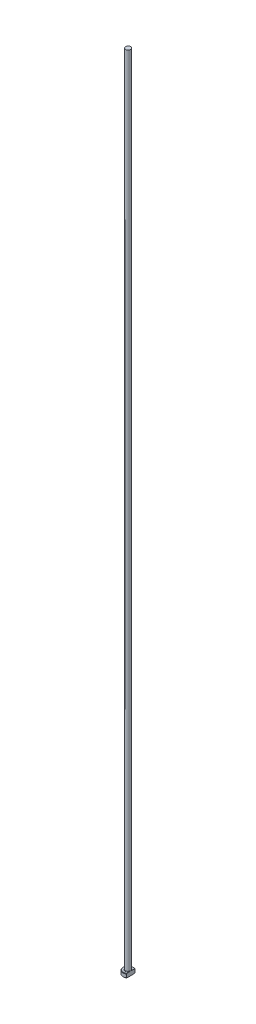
ISO-10303-21;
HEADER;
FILE_DESCRIPTION(('STEP AP214'),'2;1');
FILE_NAME('part.step','',(''),(''),'','','');
FILE_SCHEMA(('AUTOMOTIVE_DESIGN { 1 0 10303 214 1 1 1 1 }'));
ENDSEC;
DATA;
#1=APPLICATION_CONTEXT('core data for automotive mechanical design processes');
#2=APPLICATION_PROTOCOL_DEFINITION('international standard','automotive_design',2000,#1);
#3=PRODUCT_CONTEXT('',#1,'mechanical');
#4=PRODUCT('Part','Part','',(#3));
#5=PRODUCT_RELATED_PRODUCT_CATEGORY('part','',(#4));
#6=PRODUCT_DEFINITION_FORMATION('','',#4);
#7=PRODUCT_DEFINITION_CONTEXT('part definition',#1,'design');
#8=PRODUCT_DEFINITION('design','',#6,#7);
#9=PRODUCT_DEFINITION_SHAPE('','',#8);
#10=(LENGTH_UNIT() NAMED_UNIT(*) SI_UNIT(.MILLI.,.METRE.));
#11=(NAMED_UNIT(*) PLANE_ANGLE_UNIT() SI_UNIT($,.RADIAN.));
#12=(NAMED_UNIT(*) SI_UNIT($,.STERADIAN.) SOLID_ANGLE_UNIT());
#13=UNCERTAINTY_MEASURE_WITH_UNIT(LENGTH_MEASURE(1.E-05),#10,'distance_accuracy_value','');
#14=(GEOMETRIC_REPRESENTATION_CONTEXT(3) GLOBAL_UNCERTAINTY_ASSIGNED_CONTEXT((#13)) GLOBAL_UNIT_ASSIGNED_CONTEXT((#10,
#11,#12)) REPRESENTATION_CONTEXT('',''));
#15=CARTESIAN_POINT('',(0.,0.,0.));
#16=DIRECTION('',(0.,0.,1.));
#17=DIRECTION('',(1.,0.,0.));
#18=AXIS2_PLACEMENT_3D('',#15,#16,#17);
#19=CARTESIAN_POINT('',(0.,0.,0.));
#20=DIRECTION('',(0.,-1.,0.));
#21=DIRECTION('',(0.,0.,-1.));
#22=AXIS2_PLACEMENT_3D('',#19,#20,#21);
#23=PLANE('',#22);
#24=CARTESIAN_POINT('',(0.,0.,0.));
#25=DIRECTION('',(0.,-1.,0.));
#26=DIRECTION('',(0.,0.,-1.));
#27=AXIS2_PLACEMENT_3D('',#24,#25,#26);
#28=CIRCLE('',#27,2.30000000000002);
#29=CARTESIAN_POINT('',(1.24999999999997,0.,1.93067345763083));
#30=VERTEX_POINT('',#29);
#31=CARTESIAN_POINT('',(1.24999999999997,0.,-1.93067345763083));
#32=VERTEX_POINT('',#31);
#33=EDGE_CURVE('E98',#30,#32,#28,.T.);
#34=ORIENTED_EDGE('',*,*,#33,.T.);
#35=DIRECTION('',(0.,0.,1.));
#36=VECTOR('',#35,1.);
#37=CARTESIAN_POINT('',(1.24999999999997,0.,-2.16506350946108));
#38=LINE('',#37,#36);
#39=EDGE_CURVE('E83',#32,#30,#38,.T.);
#40=ORIENTED_EDGE('',*,*,#39,.T.);
#41=EDGE_LOOP('',(#34,#40));
#42=FACE_BOUND('',#41,.T.);
#43=ADVANCED_FACE('F32',(#42),#23,.T.);
#44=CARTESIAN_POINT('',(0.,259.958771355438,0.));
#45=DIRECTION('',(0.,1.,0.));
#46=DIRECTION('',(0.,0.,1.));
#47=AXIS2_PLACEMENT_3D('',#44,#45,#46);
#48=CYLINDRICAL_SURFACE('',#47,2.49999999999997);
#49=CARTESIAN_POINT('',(0.,1.79999999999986,0.));
#50=DIRECTION('',(0.,1.,0.));
#51=DIRECTION('',(0.,0.,1.));
#52=AXIS2_PLACEMENT_3D('',#49,#50,#51);
#53=CIRCLE('',#52,2.49999999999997);
#54=CARTESIAN_POINT('',(1.24999999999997,1.79999999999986,2.16506350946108));
#55=VERTEX_POINT('',#54);
#56=CARTESIAN_POINT('',(1.24999999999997,1.79999999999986,-2.16506350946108));
#57=VERTEX_POINT('',#56);
#58=EDGE_CURVE('E104',#55,#57,#53,.F.);
#59=ORIENTED_EDGE('',*,*,#58,.T.);
#60=DIRECTION('',(0.,-1.,0.));
#61=VECTOR('',#60,1.);
#62=CARTESIAN_POINT('',(1.24999999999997,400.,-2.16506350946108));
#63=LINE('',#62,#61);
#64=CARTESIAN_POINT('',(1.24999999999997,0.199999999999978,-2.16506350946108));
#65=VERTEX_POINT('',#64);
#66=EDGE_CURVE('E183',#57,#65,#63,.T.);
#67=ORIENTED_EDGE('',*,*,#66,.T.);
#68=CARTESIAN_POINT('',(0.,0.199999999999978,0.));
#69=DIRECTION('',(0.,-1.,0.));
#70=DIRECTION('',(0.,0.,-1.));
#71=AXIS2_PLACEMENT_3D('',#68,#69,#70);
#72=CIRCLE('',#71,2.49999999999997);
#73=CARTESIAN_POINT('',(1.24999999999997,0.199999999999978,2.16506350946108));
#74=VERTEX_POINT('',#73);
#75=EDGE_CURVE('E100',#65,#74,#72,.F.);
#76=ORIENTED_EDGE('',*,*,#75,.T.);
#77=DIRECTION('',(0.,-1.,0.));
#78=VECTOR('',#77,1.);
#79=CARTESIAN_POINT('',(1.24999999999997,400.,2.16506350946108));
#80=LINE('',#79,#78);
#81=EDGE_CURVE('E93',#55,#74,#80,.T.);
#82=ORIENTED_EDGE('',*,*,#81,.F.);
#83=EDGE_LOOP('',(#59,#67,#76,#82));
#84=FACE_BOUND('',#83,.T.);
#85=ADVANCED_FACE('F158',(#84),#48,.T.);
#86=CARTESIAN_POINT('',(-2.49999999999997,2.,0.));
#87=DIRECTION('',(0.,1.,0.));
#88=DIRECTION('',(0.,0.,1.));
#89=AXIS2_PLACEMENT_3D('',#86,#87,#88);
#90=PLANE('',#89);
#91=CARTESIAN_POINT('',(0.,2.,0.));
#92=DIRECTION('',(0.,1.,0.));
#93=DIRECTION('',(0.,0.,1.));
#94=AXIS2_PLACEMENT_3D('',#91,#92,#93);
#95=CIRCLE('',#94,2.29999999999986);
#96=CARTESIAN_POINT('',(1.24999999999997,2.,-1.93067345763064));
#97=VERTEX_POINT('',#96);
#98=CARTESIAN_POINT('',(1.24999999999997,2.,1.93067345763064));
#99=VERTEX_POINT('',#98);
#100=EDGE_CURVE('E178',#97,#99,#95,.T.);
#101=ORIENTED_EDGE('',*,*,#100,.T.);
#102=DIRECTION('',(0.,0.,-1.));
#103=VECTOR('',#102,1.);
#104=CARTESIAN_POINT('',(1.24999999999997,2.,0.));
#105=LINE('',#104,#103);
#106=CARTESIAN_POINT('',(1.24999999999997,1.99999999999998,0.73484692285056));
#107=VERTEX_POINT('',#106);
#108=EDGE_CURVE('E57',#99,#107,#105,.T.);
#109=ORIENTED_EDGE('',*,*,#108,.T.);
#110=CARTESIAN_POINT('',(0.,2.,0.));
#111=DIRECTION('',(0.,1.,0.));
#112=DIRECTION('',(0.,0.,1.));
#113=AXIS2_PLACEMENT_3D('',#110,#111,#112);
#114=CIRCLE('',#113,1.44999999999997);
#115=CARTESIAN_POINT('',(1.24999999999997,1.99999999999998,-0.734846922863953));
#116=VERTEX_POINT('',#115);
#117=EDGE_CURVE('E107',#107,#116,#114,.F.);
#118=ORIENTED_EDGE('',*,*,#117,.T.);
#119=EDGE_CURVE('E136',#116,#97,#105,.T.);
#120=ORIENTED_EDGE('',*,*,#119,.T.);
#121=EDGE_LOOP('',(#101,#109,#118,#120));
#122=FACE_BOUND('',#121,.T.);
#123=ADVANCED_FACE('F147',(#122),#90,.T.);
#124=CARTESIAN_POINT('',(0.,2.,0.));
#125=DIRECTION('',(0.,-1.,0.));
#126=DIRECTION('',(0.,0.,-1.));
#127=AXIS2_PLACEMENT_3D('',#124,#125,#126);
#128=CONICAL_SURFACE('',#127,2.29999999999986,0.785398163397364);
#129=ORIENTED_EDGE('',*,*,#58,.F.);
#130=CARTESIAN_POINT('',(1.24999999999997,-0.627301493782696,4.76610952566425));
#131=CARTESIAN_POINT('',(1.24999999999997,-0.522786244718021,4.65805337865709));
#132=CARTESIAN_POINT('',(1.24999999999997,-0.418383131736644,4.54988840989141));
#133=CARTESIAN_POINT('',(1.24999999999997,-0.209867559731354,4.33327605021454));
#134=CARTESIAN_POINT('',(1.24999999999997,-0.105755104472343,4.22482865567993));
#135=CARTESIAN_POINT('',(1.24999999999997,0.102163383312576,4.00753373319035));
#136=CARTESIAN_POINT('',(1.24999999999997,0.205969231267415,3.89868602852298));
#137=CARTESIAN_POINT('',(1.24999999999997,0.413121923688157,3.68055575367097));
#138=CARTESIAN_POINT('',(1.24999999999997,0.516468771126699,3.57127318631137));
#139=CARTESIAN_POINT('',(1.24999999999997,0.720522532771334,3.35432408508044));
#140=CARTESIAN_POINT('',(1.24999999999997,0.821241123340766,3.24666854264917));
#141=CARTESIAN_POINT('',(1.24999999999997,1.02192410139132,3.03065701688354));
#142=CARTESIAN_POINT('',(1.24999999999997,1.12188849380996,2.92230103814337));
#143=CARTESIAN_POINT('',(1.24999999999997,1.32077037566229,2.70467415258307));
#144=CARTESIAN_POINT('',(1.24999999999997,1.41968808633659,2.59540344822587));
#145=CARTESIAN_POINT('',(1.24999999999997,1.6160827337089,2.37557697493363));
#146=CARTESIAN_POINT('',(1.24999999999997,1.71355972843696,2.26502125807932));
#147=CARTESIAN_POINT('',(1.24999999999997,1.86911393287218,2.08515617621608));
#148=CARTESIAN_POINT('',(1.24999999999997,1.92785594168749,2.01642247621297));
#149=CARTESIAN_POINT('',(1.24999999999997,2.04429378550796,1.87806056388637));
#150=CARTESIAN_POINT('',(1.24999999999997,2.10198951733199,1.8084322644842));
#151=CARTESIAN_POINT('',(1.24999999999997,2.21658041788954,1.66728976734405));
#152=CARTESIAN_POINT('',(1.24999999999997,2.27346067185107,1.59576341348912));
#153=CARTESIAN_POINT('',(1.24999999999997,2.38522965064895,1.45118948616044));
#154=CARTESIAN_POINT('',(1.24999999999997,2.44011885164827,1.37814228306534));
#155=CARTESIAN_POINT('',(1.24999999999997,2.54788773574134,1.22886697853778));
#156=CARTESIAN_POINT('',(1.24999999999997,2.6007242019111,1.15260740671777));
#157=CARTESIAN_POINT('',(1.24999999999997,2.70212030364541,0.997098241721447));
#158=CARTESIAN_POINT('',(1.24999999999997,2.75067405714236,0.917844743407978));
#159=CARTESIAN_POINT('',(1.24999999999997,2.84043729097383,0.756494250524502));
#160=CARTESIAN_POINT('',(1.24999999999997,2.88173033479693,0.674444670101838));
#161=CARTESIAN_POINT('',(1.24999999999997,2.95366083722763,0.505835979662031));
#162=CARTESIAN_POINT('',(1.24999999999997,2.98433405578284,0.419293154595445));
#163=CARTESIAN_POINT('',(1.24999999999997,3.01753107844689,0.289507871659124));
#164=CARTESIAN_POINT('',(1.24999999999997,3.02633539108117,0.247870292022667));
#165=CARTESIAN_POINT('',(1.24999999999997,3.03997448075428,0.163937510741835));
#166=CARTESIAN_POINT('',(1.24999999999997,3.04480960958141,0.121642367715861));
#167=CARTESIAN_POINT('',(1.24999999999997,3.0501678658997,0.0369068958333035));
#168=CARTESIAN_POINT('',(1.24999999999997,3.05070431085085,-0.00553257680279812));
#169=CARTESIAN_POINT('',(1.24999999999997,3.04746162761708,-0.0902467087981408));
#170=CARTESIAN_POINT('',(1.24999999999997,3.04368214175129,-0.132521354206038));
#171=CARTESIAN_POINT('',(1.24999999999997,3.0321226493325,-0.216135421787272));
#172=CARTESIAN_POINT('',(1.24999999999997,3.02437758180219,-0.257479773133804));
#173=CARTESIAN_POINT('',(1.24999999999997,3.00536735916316,-0.339354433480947));
#174=CARTESIAN_POINT('',(1.24999999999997,2.99410082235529,-0.379884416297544));
#175=CARTESIAN_POINT('',(1.24999999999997,2.96852211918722,-0.460209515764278));
#176=CARTESIAN_POINT('',(1.24999999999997,2.95419322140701,-0.499999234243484));
#177=CARTESIAN_POINT('',(1.24999999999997,2.92306392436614,-0.578577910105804));
#178=CARTESIAN_POINT('',(1.24999999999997,2.90626403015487,-0.617367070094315));
#179=CARTESIAN_POINT('',(1.24999999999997,2.85269034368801,-0.732719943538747));
#180=CARTESIAN_POINT('',(1.24999999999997,2.8128797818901,-0.807869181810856));
#181=CARTESIAN_POINT('',(1.24999999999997,2.72799210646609,-0.955157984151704));
#182=CARTESIAN_POINT('',(1.24999999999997,2.6829085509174,-1.02729371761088));
#183=CARTESIAN_POINT('',(1.24999999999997,2.58903993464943,-1.16950551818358));
#184=CARTESIAN_POINT('',(1.24999999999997,2.54024093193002,-1.23957230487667));
#185=CARTESIAN_POINT('',(1.24999999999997,2.44021824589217,-1.37788366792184));
#186=CARTESIAN_POINT('',(1.24999999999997,2.38899576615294,-1.4461291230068));
#187=CARTESIAN_POINT('',(1.24999999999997,2.28411092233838,-1.58215279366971));
#188=CARTESIAN_POINT('',(1.24999999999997,2.23042529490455,-1.64991298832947));
#189=CARTESIAN_POINT('',(1.24999999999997,2.12172412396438,-1.78436052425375));
#190=CARTESIAN_POINT('',(1.24999999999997,2.06670849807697,-1.8510477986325));
#191=CARTESIAN_POINT('',(1.24999999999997,1.90044437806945,-2.0495441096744));
#192=CARTESIAN_POINT('',(1.24999999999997,1.78772044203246,-2.18011527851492));
#193=CARTESIAN_POINT('',(1.24999999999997,1.5792708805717,-2.41711311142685));
#194=CARTESIAN_POINT('',(1.24999999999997,1.48391557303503,-2.52386864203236));
#195=CARTESIAN_POINT('',(1.24999999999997,1.29202937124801,-2.73632311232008));
#196=CARTESIAN_POINT('',(1.24999999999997,1.19549844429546,-2.84202202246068));
#197=CARTESIAN_POINT('',(1.24999999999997,0.904469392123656,-3.15815976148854));
#198=CARTESIAN_POINT('',(1.24999999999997,0.708713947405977,-3.36743889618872));
#199=CARTESIAN_POINT('',(1.24999999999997,0.323382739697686,-3.7756119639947));
#200=CARTESIAN_POINT('',(1.24999999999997,0.133884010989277,-3.97457897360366));
#201=CARTESIAN_POINT('',(1.24999999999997,-0.151120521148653,-4.2720925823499));
#202=CARTESIAN_POINT('',(1.24999999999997,-0.246194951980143,-4.37105278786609));
#203=CARTESIAN_POINT('',(1.24999999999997,-0.436581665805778,-4.56874260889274));
#204=CARTESIAN_POINT('',(1.24999999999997,-0.531893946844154,-4.6674722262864));
#205=CARTESIAN_POINT('',(1.24999999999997,-0.627301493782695,-4.76610952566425));
#206=B_SPLINE_CURVE_WITH_KNOTS('',3,(#130,#131,#132,#133,#134,#135,#136,#137,#138,#139,#140,
#141,#142,#143,#144,#145,#146,#147,#148,#149,#150,#151,#152,#153,#154,#155,#156,#157,#158,#159,
#160,#161,#162,#163,#164,#165,#166,#167,#168,#169,#170,#171,#172,#173,#174,#175,#176,#177,#178,
#179,#180,#181,#182,#183,#184,#185,#186,#187,#188,#189,#190,#191,#192,#193,#194,#195,#196,#197,
#198,#199,#200,#201,#202,#203,#204,#205),.UNSPECIFIED.,.F.,.F.,(4,2,2,2,2,2,2,2,2,2,2,2,2,2,2,2,
2,2,2,2,2,2,2,2,2,2,2,2,2,2,2,2,2,2,2,2,2,4),(0.,0.450994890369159,0.901995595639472,
1.35322763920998,1.80445675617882,2.24672733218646,2.68899501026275,3.13116725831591,
3.57332164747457,3.84456018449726,4.11582532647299,4.38995864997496,4.66402597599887,
4.94225842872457,5.22086725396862,5.49602313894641,5.77024327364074,5.89775644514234,
6.02525831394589,6.1523650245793,6.2794822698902,6.40549833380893,6.5315639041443,
6.65833670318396,6.78508362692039,7.03983854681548,7.29490801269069,7.55098686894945,
7.8069398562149,8.06626716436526,8.32561057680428,8.84304654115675,9.27246240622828,
9.70189024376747,10.5615524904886,11.3858525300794,11.7975442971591,12.2092326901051),.UNSPECIFIED.);
#207=EDGE_CURVE('E135',#55,#99,#206,.T.);
#208=ORIENTED_EDGE('',*,*,#207,.T.);
#209=ORIENTED_EDGE('',*,*,#100,.F.);
#210=EDGE_CURVE('E127',#97,#57,#206,.T.);
#211=ORIENTED_EDGE('',*,*,#210,.T.);
#212=EDGE_LOOP('',(#129,#208,#209,#211));
#213=FACE_BOUND('',#212,.T.);
#214=ADVANCED_FACE('F143',(#213),#128,.T.);
#215=CARTESIAN_POINT('',(0.,0.199999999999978,0.));
#216=DIRECTION('',(0.,1.,0.));
#217=DIRECTION('',(0.,0.,1.));
#218=AXIS2_PLACEMENT_3D('',#215,#216,#217);
#219=CONICAL_SURFACE('',#218,2.49999999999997,0.785398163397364);
#220=ORIENTED_EDGE('',*,*,#75,.F.);
#221=CARTESIAN_POINT('',(1.24999999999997,2.62730149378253,-4.76610952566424));
#222=CARTESIAN_POINT('',(1.24999999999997,2.52278624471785,-4.65805337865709));
#223=CARTESIAN_POINT('',(1.24999999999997,2.41838313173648,-4.5498884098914));
#224=CARTESIAN_POINT('',(1.24999999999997,2.20986755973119,-4.33327605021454));
#225=CARTESIAN_POINT('',(1.24999999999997,2.10575510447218,-4.22482865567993));
#226=CARTESIAN_POINT('',(1.24999999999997,1.89783661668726,-4.00753373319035));
#227=CARTESIAN_POINT('',(1.24999999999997,1.79403076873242,-3.89868602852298));
#228=CARTESIAN_POINT('',(1.24999999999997,1.58687807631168,-3.68055575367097));
#229=CARTESIAN_POINT('',(1.24999999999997,1.48353122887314,-3.57127318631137));
#230=CARTESIAN_POINT('',(1.24999999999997,1.27947746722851,-3.35432408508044));
#231=CARTESIAN_POINT('',(1.24999999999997,1.17875887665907,-3.24666854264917));
#232=CARTESIAN_POINT('',(1.24999999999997,0.978075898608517,-3.03065701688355));
#233=CARTESIAN_POINT('',(1.24999999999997,0.87811150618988,-2.92230103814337));
#234=CARTESIAN_POINT('',(1.24999999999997,0.679229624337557,-2.70467415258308));
#235=CARTESIAN_POINT('',(1.24999999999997,0.580311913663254,-2.59540344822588));
#236=CARTESIAN_POINT('',(1.24999999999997,0.383917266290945,-2.37557697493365));
#237=CARTESIAN_POINT('',(1.24999999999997,0.286440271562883,-2.26502125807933));
#238=CARTESIAN_POINT('',(1.24999999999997,0.130886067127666,-2.08515617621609));
#239=CARTESIAN_POINT('',(1.24999999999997,0.0721440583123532,-2.01642247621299));
#240=CARTESIAN_POINT('',(1.24999999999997,-0.0442937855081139,-1.87806056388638));
#241=CARTESIAN_POINT('',(1.24999999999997,-0.101989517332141,-1.80843226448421));
#242=CARTESIAN_POINT('',(1.24999999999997,-0.216580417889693,-1.66728976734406));
#243=CARTESIAN_POINT('',(1.24999999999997,-0.273460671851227,-1.59576341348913));
#244=CARTESIAN_POINT('',(1.24999999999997,-0.385229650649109,-1.45118948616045));
#245=CARTESIAN_POINT('',(1.24999999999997,-0.440118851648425,-1.37814228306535));
#246=CARTESIAN_POINT('',(1.24999999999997,-0.547887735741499,-1.22886697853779));
#247=CARTESIAN_POINT('',(1.24999999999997,-0.600724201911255,-1.15260740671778));
#248=CARTESIAN_POINT('',(1.24999999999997,-0.702120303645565,-0.997098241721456));
#249=CARTESIAN_POINT('',(1.24999999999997,-0.750674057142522,-0.917844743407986));
#250=CARTESIAN_POINT('',(1.24999999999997,-0.840437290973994,-0.75649425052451));
#251=CARTESIAN_POINT('',(1.24999999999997,-0.881730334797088,-0.674444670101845));
#252=CARTESIAN_POINT('',(1.24999999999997,-0.953660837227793,-0.505835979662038));
#253=CARTESIAN_POINT('',(1.24999999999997,-0.984334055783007,-0.419293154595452));
#254=CARTESIAN_POINT('',(1.24999999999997,-1.01753107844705,-0.28950787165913));
#255=CARTESIAN_POINT('',(1.24999999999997,-1.02633539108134,-0.247870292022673));
#256=CARTESIAN_POINT('',(1.24999999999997,-1.03997448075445,-0.163937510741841));
#257=CARTESIAN_POINT('',(1.24999999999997,-1.04480960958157,-0.121642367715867));
#258=CARTESIAN_POINT('',(1.24999999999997,-1.05016786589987,-0.0369068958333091));
#259=CARTESIAN_POINT('',(1.24999999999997,-1.05070431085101,0.0055325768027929));
#260=CARTESIAN_POINT('',(1.24999999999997,-1.04746162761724,0.0902467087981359));
#261=CARTESIAN_POINT('',(1.24999999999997,-1.04368214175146,0.132521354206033));
#262=CARTESIAN_POINT('',(1.24999999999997,-1.03212264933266,0.216135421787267));
#263=CARTESIAN_POINT('',(1.24999999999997,-1.02437758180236,0.2574797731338));
#264=CARTESIAN_POINT('',(1.24999999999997,-1.00536735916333,0.339354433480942));
#265=CARTESIAN_POINT('',(1.24999999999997,-0.994100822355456,0.37988441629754));
#266=CARTESIAN_POINT('',(1.24999999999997,-0.968522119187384,0.460209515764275));
#267=CARTESIAN_POINT('',(1.24999999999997,-0.954193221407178,0.499999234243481));
#268=CARTESIAN_POINT('',(1.24999999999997,-0.923063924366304,0.5785779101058));
#269=CARTESIAN_POINT('',(1.24999999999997,-0.906264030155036,0.617367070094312));
#270=CARTESIAN_POINT('',(1.24999999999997,-0.852690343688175,0.732719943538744));
#271=CARTESIAN_POINT('',(1.24999999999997,-0.812879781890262,0.807869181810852));
#272=CARTESIAN_POINT('',(1.24999999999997,-0.727992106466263,0.955157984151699));
#273=CARTESIAN_POINT('',(1.24999999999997,-0.682908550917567,1.02729371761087));
#274=CARTESIAN_POINT('',(1.24999999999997,-0.589039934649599,1.16950551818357));
#275=CARTESIAN_POINT('',(1.24999999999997,-0.54024093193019,1.23957230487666));
#276=CARTESIAN_POINT('',(1.24999999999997,-0.440218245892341,1.37788366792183));
#277=CARTESIAN_POINT('',(1.24999999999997,-0.388995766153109,1.44612912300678));
#278=CARTESIAN_POINT('',(1.24999999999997,-0.284110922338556,1.58215279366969));
#279=CARTESIAN_POINT('',(1.24999999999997,-0.230425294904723,1.64991298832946));
#280=CARTESIAN_POINT('',(1.24999999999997,-0.121724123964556,1.78436052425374));
#281=CARTESIAN_POINT('',(1.24999999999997,-0.0667084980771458,1.85104779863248));
#282=CARTESIAN_POINT('',(1.24999999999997,0.0995556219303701,2.04954410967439));
#283=CARTESIAN_POINT('',(1.24999999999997,0.212279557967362,2.18011527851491));
#284=CARTESIAN_POINT('',(1.24999999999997,0.420729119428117,2.41711311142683));
#285=CARTESIAN_POINT('',(1.24999999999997,0.516084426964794,2.52386864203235));
#286=CARTESIAN_POINT('',(1.24999999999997,0.707970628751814,2.73632311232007));
#287=CARTESIAN_POINT('',(1.24999999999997,0.804501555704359,2.84202202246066));
#288=CARTESIAN_POINT('',(1.24999999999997,1.09553060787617,3.15815976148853));
#289=CARTESIAN_POINT('',(1.24999999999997,1.29128605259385,3.36743889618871));
#290=CARTESIAN_POINT('',(1.24999999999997,1.67661726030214,3.77561196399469));
#291=CARTESIAN_POINT('',(1.24999999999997,1.86611598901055,3.97457897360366));
#292=CARTESIAN_POINT('',(1.24999999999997,2.15112052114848,4.27209258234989));
#293=CARTESIAN_POINT('',(1.24999999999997,2.24619495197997,4.37105278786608));
#294=CARTESIAN_POINT('',(1.24999999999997,2.43658166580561,4.56874260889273));
#295=CARTESIAN_POINT('',(1.24999999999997,2.53189394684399,4.6674722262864));
#296=CARTESIAN_POINT('',(1.24999999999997,2.62730149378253,4.76610952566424));
#297=B_SPLINE_CURVE_WITH_KNOTS('',3,(#221,#222,#223,#224,#225,#226,#227,#228,#229,#230,#231,
#232,#233,#234,#235,#236,#237,#238,#239,#240,#241,#242,#243,#244,#245,#246,#247,#248,#249,#250,
#251,#252,#253,#254,#255,#256,#257,#258,#259,#260,#261,#262,#263,#264,#265,#266,#267,#268,#269,
#270,#271,#272,#273,#274,#275,#276,#277,#278,#279,#280,#281,#282,#283,#284,#285,#286,#287,#288,
#289,#290,#291,#292,#293,#294,#295,#296),.UNSPECIFIED.,.F.,.F.,(4,2,2,2,2,2,2,2,2,2,2,2,2,2,2,2,
2,2,2,2,2,2,2,2,2,2,2,2,2,2,2,2,2,2,2,2,2,4),(0.,0.450994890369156,0.901995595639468,
1.35322763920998,1.80445675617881,2.24672733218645,2.68899501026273,3.13116725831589,
3.57332164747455,3.84456018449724,4.11582532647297,4.38995864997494,4.66402597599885,
4.94225842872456,5.2208672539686,5.4960231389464,5.77024327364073,5.89775644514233,
6.02525831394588,6.15236502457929,6.27948226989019,6.40549833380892,6.53156390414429,
6.65833670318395,6.78508362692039,7.03983854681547,7.29490801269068,7.55098686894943,
7.80693985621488,8.06626716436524,8.32561057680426,8.84304654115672,9.27246240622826,
9.70189024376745,10.5615524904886,11.3858525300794,11.7975442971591,12.2092326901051),.UNSPECIFIED.);
#298=EDGE_CURVE('E86',#65,#32,#297,.T.);
#299=ORIENTED_EDGE('',*,*,#298,.T.);
#300=ORIENTED_EDGE('',*,*,#33,.F.);
#301=EDGE_CURVE('E89',#30,#74,#297,.T.);
#302=ORIENTED_EDGE('',*,*,#301,.T.);
#303=EDGE_LOOP('',(#220,#299,#300,#302));
#304=FACE_BOUND('',#303,.T.);
#305=ADVANCED_FACE('F97',(#304),#219,.T.);
#306=CARTESIAN_POINT('',(0.,2.19999999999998,0.));
#307=DIRECTION('',(0.,1.,0.));
#308=DIRECTION('',(0.,0.,1.));
#309=AXIS2_PLACEMENT_3D('',#306,#307,#308);
#310=TOROIDAL_SURFACE('',#309,1.44999999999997,0.2);
#311=CARTESIAN_POINT('',(1.24999999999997,2.19999999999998,0.));
#312=CARTESIAN_POINT('',(1.24999999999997,2.20000051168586,-1.9767961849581E-10));
#313=CARTESIAN_POINT('',(1.24999999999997,2.20000102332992,-1.08908063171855E-07));
#314=CARTESIAN_POINT('',(1.24999999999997,2.20000200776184,-4.52594759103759E-07));
#315=CARTESIAN_POINT('',(1.24999999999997,2.20000247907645,-6.90993033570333E-07));
#316=CARTESIAN_POINT('',(1.24999999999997,2.20000341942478,-1.26357942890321E-06));
#317=CARTESIAN_POINT('',(1.24999999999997,2.20000388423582,-1.60457617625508E-06));
#318=CARTESIAN_POINT('',(1.24999999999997,2.20000476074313,-2.3395489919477E-06));
#319=CARTESIAN_POINT('',(1.24999999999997,2.20000517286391,-2.7330414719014E-06));
#320=CARTESIAN_POINT('',(1.24999999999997,2.20000655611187,-4.14544010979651E-06));
#321=CARTESIAN_POINT('',(1.24999999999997,2.20000745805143,-5.23310089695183E-06));
#322=CARTESIAN_POINT('',(1.24999999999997,2.20000906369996,-7.47950358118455E-06));
#323=CARTESIAN_POINT('',(1.24999999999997,2.20000977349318,-8.63414435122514E-06));
#324=CARTESIAN_POINT('',(1.24999999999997,2.20001244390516,-1.31453476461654E-05));
#325=CARTESIAN_POINT('',(1.24999999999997,2.20001426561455,-1.65880555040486E-05));
#326=CARTESIAN_POINT('',(1.24999999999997,2.20001724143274,-2.33729028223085E-05));
#327=CARTESIAN_POINT('',(1.24999999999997,2.20001844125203,-2.66956153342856E-05));
#328=CARTESIAN_POINT('',(1.24999999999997,2.2000235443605,-4.08635084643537E-05));
#329=CARTESIAN_POINT('',(1.24999999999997,2.20002741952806,-5.17114612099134E-05));
#330=CARTESIAN_POINT('',(1.24999999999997,2.20003363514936,-7.20057670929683E-05));
#331=CARTESIAN_POINT('',(1.24999999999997,2.20003612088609,-8.14057063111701E-05));
#332=CARTESIAN_POINT('',(1.24999999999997,2.20005581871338,-0.000149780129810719));
#333=CARTESIAN_POINT('',(1.24999999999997,2.20008094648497,-0.000206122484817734));
#334=CARTESIAN_POINT('',(1.24999999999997,2.20017507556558,-0.000425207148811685));
#335=CARTESIAN_POINT('',(1.24999999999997,2.20023819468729,-0.000589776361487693));
#336=CARTESIAN_POINT('',(1.24999999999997,2.20048692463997,-0.00122878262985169));
#337=CARTESIAN_POINT('',(1.24999999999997,2.20067870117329,-0.00170134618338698));
#338=CARTESIAN_POINT('',(1.24999999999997,2.20146022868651,-0.00363636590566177));
#339=CARTESIAN_POINT('',(1.24999999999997,2.20204298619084,-0.00510090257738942));
#340=CARTESIAN_POINT('',(1.24999999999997,2.20939719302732,-0.0235712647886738));
#341=CARTESIAN_POINT('',(1.24999999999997,2.21621259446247,-0.0405643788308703));
#342=CARTESIAN_POINT('',(1.24999999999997,2.22951000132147,-0.0739606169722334));
#343=CARTESIAN_POINT('',(1.24999999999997,2.23599508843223,-0.0903626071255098));
#344=CARTESIAN_POINT('',(1.24999999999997,2.24961430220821,-0.12511129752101));
#345=CARTESIAN_POINT('',(1.24999999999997,2.25673641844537,-0.143462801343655));
#346=CARTESIAN_POINT('',(1.24999999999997,2.27085039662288,-0.180427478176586));
#347=CARTESIAN_POINT('',(1.24999999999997,2.27784022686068,-0.199041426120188));
#348=CARTESIAN_POINT('',(1.24999999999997,2.29479134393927,-0.245221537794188));
#349=CARTESIAN_POINT('',(1.24999999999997,2.30459026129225,-0.272848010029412));
#350=CARTESIAN_POINT('',(1.24999999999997,2.32310234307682,-0.327738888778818));
#351=CARTESIAN_POINT('',(1.24999999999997,2.33183568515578,-0.354996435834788));
#352=CARTESIAN_POINT('',(1.24999999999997,2.3493656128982,-0.41374417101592));
#353=CARTESIAN_POINT('',(1.24999999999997,2.35799470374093,-0.445285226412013));
#354=CARTESIAN_POINT('',(1.24999999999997,2.37338463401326,-0.509091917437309));
#355=CARTESIAN_POINT('',(1.24999999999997,2.38013036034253,-0.541361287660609));
#356=CARTESIAN_POINT('',(1.24999999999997,2.39136059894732,-0.608339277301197));
#357=CARTESIAN_POINT('',(1.24999999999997,2.39568167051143,-0.643076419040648));
#358=CARTESIAN_POINT('',(1.24999999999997,2.40037605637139,-0.712733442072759));
#359=CARTESIAN_POINT('',(1.24999999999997,2.40076553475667,-0.747651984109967));
#360=CARTESIAN_POINT('',(1.24999999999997,2.39677668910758,-0.8081037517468));
#361=CARTESIAN_POINT('',(1.24999999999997,2.39361441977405,-0.833711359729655));
#362=CARTESIAN_POINT('',(1.24999999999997,2.38355990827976,-0.883915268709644));
#363=CARTESIAN_POINT('',(1.24999999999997,2.37671813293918,-0.908520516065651));
#364=CARTESIAN_POINT('',(1.24999999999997,2.36252570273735,-0.944879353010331));
#365=CARTESIAN_POINT('',(1.24999999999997,2.35688428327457,-0.957298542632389));
#366=CARTESIAN_POINT('',(1.24999999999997,2.34399066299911,-0.981318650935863));
#367=CARTESIAN_POINT('',(1.24999999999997,2.33673636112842,-0.992918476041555));
#368=CARTESIAN_POINT('',(1.24999999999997,2.32199744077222,-1.01267533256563));
#369=CARTESIAN_POINT('',(1.24999999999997,2.31482723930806,-1.02106482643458));
#370=CARTESIAN_POINT('',(1.24999999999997,2.29924321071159,-1.03659690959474));
#371=CARTESIAN_POINT('',(1.24999999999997,2.29083198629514,-1.04374204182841));
#372=CARTESIAN_POINT('',(1.24999999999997,2.27498600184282,-1.05478694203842));
#373=CARTESIAN_POINT('',(1.24999999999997,2.26780814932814,-1.05905359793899));
#374=CARTESIAN_POINT('',(1.24999999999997,2.25284782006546,-1.06635953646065));
#375=CARTESIAN_POINT('',(1.24999999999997,2.24506572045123,-1.06939957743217));
#376=CARTESIAN_POINT('',(1.24999999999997,2.22901828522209,-1.07404931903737));
#377=CARTESIAN_POINT('',(1.24999999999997,2.22074990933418,-1.07564870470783));
#378=CARTESIAN_POINT('',(1.24999999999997,2.20405985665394,-1.07723717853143));
#379=CARTESIAN_POINT('',(1.24999999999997,2.19563825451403,-1.07722703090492));
#380=CARTESIAN_POINT('',(1.24999999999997,2.17988128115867,-1.07569157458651));
#381=CARTESIAN_POINT('',(1.24999999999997,2.17252879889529,-1.0743339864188));
#382=CARTESIAN_POINT('',(1.24999999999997,2.15814333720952,-1.07044616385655));
#383=CARTESIAN_POINT('',(1.24999999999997,2.15111040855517,-1.06791574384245));
#384=CARTESIAN_POINT('',(1.24999999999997,2.13724955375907,-1.06171920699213));
#385=CARTESIAN_POINT('',(1.24999999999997,2.13043935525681,-1.05801386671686));
#386=CARTESIAN_POINT('',(1.24999999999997,2.11740316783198,-1.04969609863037));
#387=CARTESIAN_POINT('',(1.24999999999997,2.11117742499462,-1.04508329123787));
#388=CARTESIAN_POINT('',(1.24999999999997,2.09586196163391,-1.03220341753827));
#389=CARTESIAN_POINT('',(1.24999999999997,2.08723799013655,-1.02338140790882));
#390=CARTESIAN_POINT('',(1.24999999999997,2.07148817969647,-1.00448021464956));
#391=CARTESIAN_POINT('',(1.24999999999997,2.0643671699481,-0.994397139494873));
#392=CARTESIAN_POINT('',(1.24999999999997,2.04800089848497,-0.967694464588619));
#393=CARTESIAN_POINT('',(1.24999999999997,2.0397014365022,-0.950498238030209));
#394=CARTESIAN_POINT('',(1.24999999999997,2.02582422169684,-0.915117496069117));
#395=CARTESIAN_POINT('',(1.24999999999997,2.02024415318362,-0.896933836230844));
#396=CARTESIAN_POINT('',(1.24999999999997,2.00805724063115,-0.846781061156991));
#397=CARTESIAN_POINT('',(1.24999999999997,2.00359525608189,-0.8142976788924));
#398=CARTESIAN_POINT('',(1.24999999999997,1.99933348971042,-0.748574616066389));
#399=CARTESIAN_POINT('',(1.24999999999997,1.99961552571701,-0.715331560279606));
#400=CARTESIAN_POINT('',(1.24999999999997,2.00446632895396,-0.637920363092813));
#401=CARTESIAN_POINT('',(1.24999999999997,2.01044886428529,-0.593849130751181));
#402=CARTESIAN_POINT('',(1.24999999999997,2.02681929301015,-0.506401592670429));
#403=CARTESIAN_POINT('',(1.24999999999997,2.03722697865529,-0.463029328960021));
#404=CARTESIAN_POINT('',(1.24999999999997,2.06007158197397,-0.380638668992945));
#405=CARTESIAN_POINT('',(1.24999999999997,2.07227412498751,-0.34155342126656));
#406=CARTESIAN_POINT('',(1.24999999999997,2.09824323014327,-0.264347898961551));
#407=CARTESIAN_POINT('',(1.24999999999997,2.11199311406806,-0.226221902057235));
#408=CARTESIAN_POINT('',(1.24999999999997,2.13108825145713,-0.175350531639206));
#409=CARTESIAN_POINT('',(1.24999999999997,2.13599999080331,-0.16243890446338));
#410=CARTESIAN_POINT('',(1.24999999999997,2.14604281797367,-0.13631825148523));
#411=CARTESIAN_POINT('',(1.24999999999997,2.15117629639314,-0.123110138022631));
#412=CARTESIAN_POINT('',(1.24999999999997,2.16341702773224,-0.0918425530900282));
#413=CARTESIAN_POINT('',(1.24999999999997,2.17055250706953,-0.0737943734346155));
#414=CARTESIAN_POINT('',(1.24999999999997,2.18426943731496,-0.0393586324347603));
#415=CARTESIAN_POINT('',(1.24999999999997,2.19084281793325,-0.0229681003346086));
#416=CARTESIAN_POINT('',(1.24999999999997,2.19795564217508,-0.00510438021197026));
#417=CARTESIAN_POINT('',(1.24999999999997,2.19853702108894,-0.00364331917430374));
#418=CARTESIAN_POINT('',(1.24999999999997,2.19931818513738,-0.00170914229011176));
#419=CARTESIAN_POINT('',(1.24999999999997,2.19951102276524,-0.00123396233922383));
#420=CARTESIAN_POINT('',(1.24999999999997,2.19976104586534,-0.000591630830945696));
#421=CARTESIAN_POINT('',(1.24999999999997,2.19982443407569,-0.000426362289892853));
#422=CARTESIAN_POINT('',(1.24999999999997,2.1999189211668,-0.000206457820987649));
#423=CARTESIAN_POINT('',(1.24999999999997,2.19994410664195,-0.000149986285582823));
#424=CARTESIAN_POINT('',(1.24999999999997,2.19996383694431,-8.1464748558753E-05));
#425=CARTESIAN_POINT('',(1.24999999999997,2.19996632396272,-7.20551566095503E-05));
#426=CARTESIAN_POINT('',(1.24999999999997,2.19997254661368,-5.17396175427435E-05));
#427=CARTESIAN_POINT('',(1.24999999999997,2.19997642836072,-4.08803462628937E-05));
#428=CARTESIAN_POINT('',(1.24999999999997,2.19998153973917,-2.66997572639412E-05));
#429=CARTESIAN_POINT('',(1.24999999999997,2.1999827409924,-2.33755457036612E-05));
#430=CARTESIAN_POINT('',(1.24999999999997,2.19998572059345,-1.65878757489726E-05));
#431=CARTESIAN_POINT('',(1.24999999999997,2.19998754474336,-1.31438993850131E-05));
#432=CARTESIAN_POINT('',(1.24999999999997,2.19999021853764,-8.63150510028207E-06));
#433=CARTESIAN_POINT('',(1.24999999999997,2.19999092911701,-7.47674879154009E-06));
#434=CARTESIAN_POINT('',(1.24999999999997,2.19999253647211,-5.23027079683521E-06));
#435=CARTESIAN_POINT('',(1.24999999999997,2.19999343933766,-4.14265820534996E-06));
#436=CARTESIAN_POINT('',(1.24999999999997,2.19999482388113,-2.73051190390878E-06));
#437=CARTESIAN_POINT('',(1.24999999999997,2.19999523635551,-2.33712918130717E-06));
#438=CARTESIAN_POINT('',(1.24999999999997,2.19999611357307,-1.60243917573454E-06));
#439=CARTESIAN_POINT('',(1.24999999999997,2.19999657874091,-1.26161620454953E-06));
#440=CARTESIAN_POINT('',(1.24999999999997,2.19999751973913,-6.89449591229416E-07));
#441=CARTESIAN_POINT('',(1.24999999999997,2.19999799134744,-4.51288697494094E-07));
#442=CARTESIAN_POINT('',(1.24999999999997,2.19999897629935,-1.08178109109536E-07));
#443=CARTESIAN_POINT('',(1.24999999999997,2.19999948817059,1.97735059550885E-10));
#444=CARTESIAN_POINT('',(1.24999999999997,2.19999999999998,0.));
#445=B_SPLINE_CURVE_WITH_KNOTS('',3,(#311,#312,#313,#314,#315,#316,#317,#318,#319,#320,#321,
#322,#323,#324,#325,#326,#327,#328,#329,#330,#331,#332,#333,#334,#335,#336,#337,#338,#339,#340,
#341,#342,#343,#344,#345,#346,#347,#348,#349,#350,#351,#352,#353,#354,#355,#356,#357,#358,#359,
#360,#361,#362,#363,#364,#365,#366,#367,#368,#369,#370,#371,#372,#373,#374,#375,#376,#377,#378,
#379,#380,#381,#382,#383,#384,#385,#386,#387,#388,#389,#390,#391,#392,#393,#394,#395,#396,#397,
#398,#399,#400,#401,#402,#403,#404,#405,#406,#407,#408,#409,#410,#411,#412,#413,#414,#415,#416,
#417,#418,#419,#420,#421,#422,#423,#424,#425,#426,#427,#428,#429,#430,#431,#432,#433,#434,#435,
#436,#437,#438,#439,#440,#441,#442,#443,#444),.UNSPECIFIED.,.T.,.F.,(4,2,2,2,2,2,2,2,2,2,2,2,2,
2,2,2,2,2,2,2,2,2,2,2,2,2,2,2,2,2,2,2,2,2,2,2,2,2,2,2,2,2,2,2,2,2,2,2,2,2,2,2,2,2,2,2,2,2,2,2,2,
2,2,2,2,2,4),(0.,1.53427576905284E-06,3.11115061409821E-06,4.83351643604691E-06,
6.54098955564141E-06,1.07594295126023E-05,1.48222852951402E-05,2.64707315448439E-05,
3.70576290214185E-05,7.16088727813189E-05,0.000100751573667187,0.000285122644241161,
0.000814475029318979,0.00234373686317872,0.00707317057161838,0.061994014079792,
0.114907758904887,0.173961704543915,0.233609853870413,0.321537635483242,0.407388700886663,
0.505443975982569,0.604264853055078,0.709126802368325,0.813557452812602,0.890773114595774,
0.966955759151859,1.00778845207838,1.04867465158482,1.08167318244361,1.1146034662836,
1.13955805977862,1.16449720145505,1.18961351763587,1.21471790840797,1.23704542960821,
1.25937648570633,1.28254952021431,1.30573226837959,1.34253218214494,1.37944859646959,
1.43640829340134,1.4933194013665,1.59113685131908,1.69064301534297,1.82371118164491,
1.9573808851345,2.08016146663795,2.20172662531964,2.24316968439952,2.28568093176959,
2.34390494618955,2.39687801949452,2.40159623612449,2.40313396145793,2.40366556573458,
2.40385035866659,2.40387953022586,2.40391411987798,2.40392471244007,2.40393636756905,
2.4039404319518,2.40394465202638,2.40394636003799,2.4039480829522,2.40394966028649,
2.40395119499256),.UNSPECIFIED.);
#446=CARTESIAN_POINT('',(1.24999999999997,2.19999999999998,0.));
#447=VERTEX_POINT('',#446);
#448=EDGE_CURVE('E11',#116,#447,#445,.T.);
#449=ORIENTED_EDGE('',*,*,#448,.F.);
#450=ORIENTED_EDGE('',*,*,#117,.F.);
#451=CARTESIAN_POINT('',(1.24999999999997,2.19999999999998,0.));
#452=CARTESIAN_POINT('',(1.24999999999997,2.1999994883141,1.97679627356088E-10));
#453=CARTESIAN_POINT('',(1.24999999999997,2.19999897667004,1.08908063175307E-07));
#454=CARTESIAN_POINT('',(1.24999999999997,2.19999799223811,4.52594759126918E-07));
#455=CARTESIAN_POINT('',(1.24999999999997,2.19999752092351,6.90993033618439E-07));
#456=CARTESIAN_POINT('',(1.24999999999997,2.19999658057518,1.26357942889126E-06));
#457=CARTESIAN_POINT('',(1.24999999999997,2.19999611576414,1.60457617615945E-06));
#458=CARTESIAN_POINT('',(1.24999999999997,2.19999523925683,2.33954899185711E-06));
#459=CARTESIAN_POINT('',(1.24999999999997,2.19999482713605,2.73304147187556E-06));
#460=CARTESIAN_POINT('',(1.24999999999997,2.19999344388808,4.14544010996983E-06));
#461=CARTESIAN_POINT('',(1.24999999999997,2.19999254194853,5.23310089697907E-06));
#462=CARTESIAN_POINT('',(1.24999999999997,2.1999909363,7.47950358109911E-06));
#463=CARTESIAN_POINT('',(1.24999999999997,2.19999022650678,8.63414435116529E-06));
#464=CARTESIAN_POINT('',(1.24999999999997,2.1999875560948,1.3145347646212E-05));
#465=CARTESIAN_POINT('',(1.24999999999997,2.19998573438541,1.65880555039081E-05));
#466=CARTESIAN_POINT('',(1.24999999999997,2.19998275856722,2.33729028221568E-05));
#467=CARTESIAN_POINT('',(1.24999999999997,2.19998155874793,2.66956153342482E-05));
#468=CARTESIAN_POINT('',(1.24999999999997,2.19997645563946,4.08635084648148E-05));
#469=CARTESIAN_POINT('',(1.24999999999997,2.1999725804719,5.1711461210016E-05));
#470=CARTESIAN_POINT('',(1.24999999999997,2.1999663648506,7.2005767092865E-05));
#471=CARTESIAN_POINT('',(1.24999999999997,2.19996387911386,8.14057063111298E-05));
#472=CARTESIAN_POINT('',(1.24999999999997,2.19994418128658,0.000149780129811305));
#473=CARTESIAN_POINT('',(1.24999999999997,2.19991905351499,0.000206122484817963));
#474=CARTESIAN_POINT('',(1.24999999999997,2.19982492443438,0.000425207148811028));
#475=CARTESIAN_POINT('',(1.24999999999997,2.19976180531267,0.000589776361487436));
#476=CARTESIAN_POINT('',(1.24999999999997,2.19951307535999,0.00122878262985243));
#477=CARTESIAN_POINT('',(1.24999999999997,2.19932129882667,0.00170134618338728));
#478=CARTESIAN_POINT('',(1.24999999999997,2.19853977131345,0.00363636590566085));
#479=CARTESIAN_POINT('',(1.24999999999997,2.19795701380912,0.00510090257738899));
#480=CARTESIAN_POINT('',(1.24999999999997,2.19060280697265,0.0235712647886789));
#481=CARTESIAN_POINT('',(1.24999999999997,2.18378740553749,0.0405643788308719));
#482=CARTESIAN_POINT('',(1.24999999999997,2.17048999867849,0.0739606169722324));
#483=CARTESIAN_POINT('',(1.24999999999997,2.16400491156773,0.0903626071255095));
#484=CARTESIAN_POINT('',(1.24999999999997,2.15038569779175,0.125111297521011));
#485=CARTESIAN_POINT('',(1.24999999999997,2.14326358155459,0.143462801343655));
#486=CARTESIAN_POINT('',(1.24999999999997,2.12914960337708,0.180427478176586));
#487=CARTESIAN_POINT('',(1.24999999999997,2.12215977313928,0.199041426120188));
#488=CARTESIAN_POINT('',(1.24999999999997,2.10520865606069,0.245221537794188));
#489=CARTESIAN_POINT('',(1.24999999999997,2.09540973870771,0.272848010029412));
#490=CARTESIAN_POINT('',(1.24999999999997,2.07689765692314,0.327738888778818));
#491=CARTESIAN_POINT('',(1.24999999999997,2.06816431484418,0.354996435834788));
#492=CARTESIAN_POINT('',(1.24999999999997,2.05063438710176,0.41374417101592));
#493=CARTESIAN_POINT('',(1.24999999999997,2.04200529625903,0.445285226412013));
#494=CARTESIAN_POINT('',(1.24999999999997,2.0266153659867,0.509091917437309));
#495=CARTESIAN_POINT('',(1.24999999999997,2.01986963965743,0.541361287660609));
#496=CARTESIAN_POINT('',(1.24999999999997,2.00863940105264,0.608339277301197));
#497=CARTESIAN_POINT('',(1.24999999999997,2.00431832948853,0.643076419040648));
#498=CARTESIAN_POINT('',(1.24999999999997,1.99962394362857,0.712733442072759));
#499=CARTESIAN_POINT('',(1.24999999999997,1.99923446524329,0.747651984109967));
#500=CARTESIAN_POINT('',(1.24999999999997,2.00322331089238,0.8081037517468));
#501=CARTESIAN_POINT('',(1.24999999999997,2.00638558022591,0.833711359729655));
#502=CARTESIAN_POINT('',(1.24999999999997,2.0164400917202,0.883915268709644));
#503=CARTESIAN_POINT('',(1.24999999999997,2.02328186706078,0.908520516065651));
#504=CARTESIAN_POINT('',(1.24999999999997,2.03747429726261,0.944879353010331));
#505=CARTESIAN_POINT('',(1.24999999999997,2.04311571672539,0.957298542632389));
#506=CARTESIAN_POINT('',(1.24999999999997,2.05600933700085,0.981318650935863));
#507=CARTESIAN_POINT('',(1.24999999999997,2.06326363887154,0.992918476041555));
#508=CARTESIAN_POINT('',(1.24999999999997,2.07800255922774,1.01267533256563));
#509=CARTESIAN_POINT('',(1.24999999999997,2.0851727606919,1.02106482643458));
#510=CARTESIAN_POINT('',(1.24999999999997,2.10075678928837,1.03659690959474));
#511=CARTESIAN_POINT('',(1.24999999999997,2.10916801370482,1.04374204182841));
#512=CARTESIAN_POINT('',(1.24999999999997,2.12501399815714,1.05478694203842));
#513=CARTESIAN_POINT('',(1.24999999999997,2.13219185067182,1.05905359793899));
#514=CARTESIAN_POINT('',(1.24999999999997,2.1471521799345,1.06635953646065));
#515=CARTESIAN_POINT('',(1.24999999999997,2.15493427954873,1.06939957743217));
#516=CARTESIAN_POINT('',(1.24999999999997,2.17098171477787,1.07404931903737));
#517=CARTESIAN_POINT('',(1.24999999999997,2.17925009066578,1.07564870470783));
#518=CARTESIAN_POINT('',(1.24999999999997,2.19594014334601,1.07723717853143));
#519=CARTESIAN_POINT('',(1.24999999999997,2.20436174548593,1.07722703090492));
#520=CARTESIAN_POINT('',(1.24999999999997,2.22011871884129,1.07569157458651));
#521=CARTESIAN_POINT('',(1.24999999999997,2.22747120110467,1.0743339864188));
#522=CARTESIAN_POINT('',(1.24999999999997,2.24185666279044,1.07044616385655));
#523=CARTESIAN_POINT('',(1.24999999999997,2.24888959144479,1.06791574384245));
#524=CARTESIAN_POINT('',(1.24999999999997,2.26275044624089,1.06171920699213));
#525=CARTESIAN_POINT('',(1.24999999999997,2.26956064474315,1.05801386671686));
#526=CARTESIAN_POINT('',(1.24999999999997,2.28259683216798,1.04969609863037));
#527=CARTESIAN_POINT('',(1.24999999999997,2.28882257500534,1.04508329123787));
#528=CARTESIAN_POINT('',(1.24999999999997,2.30413803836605,1.03220341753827));
#529=CARTESIAN_POINT('',(1.24999999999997,2.31276200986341,1.02338140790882));
#530=CARTESIAN_POINT('',(1.24999999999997,2.32851182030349,1.00448021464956));
#531=CARTESIAN_POINT('',(1.24999999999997,2.33563283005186,0.994397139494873));
#532=CARTESIAN_POINT('',(1.24999999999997,2.35199910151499,0.967694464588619));
#533=CARTESIAN_POINT('',(1.24999999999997,2.36029856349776,0.950498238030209));
#534=CARTESIAN_POINT('',(1.24999999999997,2.37417577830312,0.915117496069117));
#535=CARTESIAN_POINT('',(1.24999999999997,2.37975584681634,0.896933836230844));
#536=CARTESIAN_POINT('',(1.24999999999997,2.3919427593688,0.846781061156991));
#537=CARTESIAN_POINT('',(1.24999999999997,2.39640474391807,0.8142976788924));
#538=CARTESIAN_POINT('',(1.24999999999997,2.40066651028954,0.748574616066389));
#539=CARTESIAN_POINT('',(1.24999999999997,2.40038447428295,0.715331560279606));
#540=CARTESIAN_POINT('',(1.24999999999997,2.395533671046,0.637920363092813));
#541=CARTESIAN_POINT('',(1.24999999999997,2.38955113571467,0.593849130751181));
#542=CARTESIAN_POINT('',(1.24999999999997,2.3731807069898,0.506401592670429));
#543=CARTESIAN_POINT('',(1.24999999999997,2.36277302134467,0.463029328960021));
#544=CARTESIAN_POINT('',(1.24999999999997,2.33992841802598,0.380638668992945));
#545=CARTESIAN_POINT('',(1.24999999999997,2.32772587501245,0.34155342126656));
#546=CARTESIAN_POINT('',(1.24999999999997,2.30175676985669,0.264347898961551));
#547=CARTESIAN_POINT('',(1.24999999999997,2.2880068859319,0.226221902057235));
#548=CARTESIAN_POINT('',(1.24999999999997,2.26891174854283,0.175350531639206));
#549=CARTESIAN_POINT('',(1.24999999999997,2.26400000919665,0.162438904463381));
#550=CARTESIAN_POINT('',(1.24999999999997,2.25395718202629,0.13631825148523));
#551=CARTESIAN_POINT('',(1.24999999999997,2.24882370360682,0.123110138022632));
#552=CARTESIAN_POINT('',(1.24999999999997,2.23658297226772,0.091842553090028));
#553=CARTESIAN_POINT('',(1.24999999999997,2.22944749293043,0.0737943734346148));
#554=CARTESIAN_POINT('',(1.24999999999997,2.215730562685,0.0393586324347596));
#555=CARTESIAN_POINT('',(1.24999999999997,2.20915718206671,0.0229681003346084));
#556=CARTESIAN_POINT('',(1.24999999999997,2.20204435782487,0.00510438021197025));
#557=CARTESIAN_POINT('',(1.24999999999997,2.20146297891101,0.00364331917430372));
#558=CARTESIAN_POINT('',(1.24999999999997,2.20068181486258,0.00170914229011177));
#559=CARTESIAN_POINT('',(1.24999999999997,2.20048897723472,0.00123396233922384));
#560=CARTESIAN_POINT('',(1.24999999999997,2.20023895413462,0.000591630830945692));
#561=CARTESIAN_POINT('',(1.24999999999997,2.20017556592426,0.000426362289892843));
#562=CARTESIAN_POINT('',(1.24999999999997,2.20008107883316,0.000206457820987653));
#563=CARTESIAN_POINT('',(1.24999999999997,2.20005589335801,0.000149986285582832));
#564=CARTESIAN_POINT('',(1.24999999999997,2.20003616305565,8.14647485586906E-05));
#565=CARTESIAN_POINT('',(1.24999999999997,2.20003367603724,7.20551566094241E-05));
#566=CARTESIAN_POINT('',(1.24999999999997,2.20002745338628,5.17396175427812E-05));
#567=CARTESIAN_POINT('',(1.24999999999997,2.20002357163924,4.08803462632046E-05));
#568=CARTESIAN_POINT('',(1.24999999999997,2.20001846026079,2.66997572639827E-05));
#569=CARTESIAN_POINT('',(1.24999999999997,2.20001725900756,2.33755457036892E-05));
#570=CARTESIAN_POINT('',(1.24999999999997,2.20001427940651,1.65878757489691E-05));
#571=CARTESIAN_POINT('',(1.24999999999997,2.2000124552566,1.31438993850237E-05));
#572=CARTESIAN_POINT('',(1.24999999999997,2.20000978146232,8.63150510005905E-06));
#573=CARTESIAN_POINT('',(1.24999999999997,2.20000907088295,7.47674879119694E-06));
#574=CARTESIAN_POINT('',(1.24999999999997,2.20000746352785,5.23027079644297E-06));
#575=CARTESIAN_POINT('',(1.24999999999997,2.2000065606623,4.14265820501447E-06));
#576=CARTESIAN_POINT('',(1.24999999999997,2.20000517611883,2.7305119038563E-06));
#577=CARTESIAN_POINT('',(1.24999999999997,2.20000476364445,2.33712918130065E-06));
#578=CARTESIAN_POINT('',(1.24999999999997,2.20000388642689,1.60243917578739E-06));
#579=CARTESIAN_POINT('',(1.24999999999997,2.20000342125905,1.26161620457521E-06));
#580=CARTESIAN_POINT('',(1.24999999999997,2.20000248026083,6.89449591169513E-07));
#581=CARTESIAN_POINT('',(1.24999999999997,2.20000200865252,4.51288697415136E-07));
#582=CARTESIAN_POINT('',(1.24999999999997,2.20000102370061,1.0817810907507E-07));
#583=CARTESIAN_POINT('',(1.24999999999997,2.20000051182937,-1.97735068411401E-10));
#584=CARTESIAN_POINT('',(1.24999999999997,2.19999999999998,0.));
#585=B_SPLINE_CURVE_WITH_KNOTS('',3,(#451,#452,#453,#454,#455,#456,#457,#458,#459,#460,#461,
#462,#463,#464,#465,#466,#467,#468,#469,#470,#471,#472,#473,#474,#475,#476,#477,#478,#479,#480,
#481,#482,#483,#484,#485,#486,#487,#488,#489,#490,#491,#492,#493,#494,#495,#496,#497,#498,#499,
#500,#501,#502,#503,#504,#505,#506,#507,#508,#509,#510,#511,#512,#513,#514,#515,#516,#517,#518,
#519,#520,#521,#522,#523,#524,#525,#526,#527,#528,#529,#530,#531,#532,#533,#534,#535,#536,#537,
#538,#539,#540,#541,#542,#543,#544,#545,#546,#547,#548,#549,#550,#551,#552,#553,#554,#555,#556,
#557,#558,#559,#560,#561,#562,#563,#564,#565,#566,#567,#568,#569,#570,#571,#572,#573,#574,#575,
#576,#577,#578,#579,#580,#581,#582,#583,#584),.UNSPECIFIED.,.T.,.F.,(4,2,2,2,2,2,2,2,2,2,2,2,2,
2,2,2,2,2,2,2,2,2,2,2,2,2,2,2,2,2,2,2,2,2,2,2,2,2,2,2,2,2,2,2,2,2,2,2,2,2,2,2,2,2,2,2,2,2,2,2,2,
2,2,2,2,2,4),(0.,1.53427576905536E-06,3.11115061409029E-06,4.83351643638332E-06,
6.54098955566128E-06,1.07594295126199E-05,1.48222852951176E-05,2.64707315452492E-05,
3.7057629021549E-05,7.16088727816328E-05,0.000100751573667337,0.000285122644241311,
0.00081447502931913,0.00234373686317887,0.00707317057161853,0.0619940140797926,
0.114907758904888,0.173961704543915,0.233609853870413,0.321537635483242,0.407388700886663,
0.50544397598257,0.604264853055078,0.709126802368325,0.813557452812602,0.890773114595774,
0.966955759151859,1.00778845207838,1.04867465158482,1.08167318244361,1.1146034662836,
1.13955805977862,1.16449720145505,1.18961351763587,1.21471790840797,1.23704542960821,
1.25937648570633,1.28254952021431,1.30573226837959,1.34253218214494,1.37944859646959,
1.43640829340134,1.4933194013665,1.59113685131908,1.69064301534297,1.82371118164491,
1.9573808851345,2.08016146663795,2.20172662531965,2.24316968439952,2.28568093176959,
2.34390494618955,2.39687801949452,2.40159623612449,2.40313396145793,2.40366556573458,
2.40385035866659,2.40387953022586,2.40391411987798,2.40392471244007,2.40393636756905,
2.40394043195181,2.40394465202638,2.40394636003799,2.4039480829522,2.40394966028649,
2.40395119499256),.UNSPECIFIED.);
#586=EDGE_CURVE('E46',#447,#107,#585,.T.);
#587=ORIENTED_EDGE('',*,*,#586,.F.);
#588=CARTESIAN_POINT('',(0.,2.19999999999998,0.));
#589=DIRECTION('',(0.,1.,0.));
#590=DIRECTION('',(0.,0.,1.));
#591=AXIS2_PLACEMENT_3D('',#588,#589,#590);
#592=CIRCLE('',#591,1.24999999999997);
#593=EDGE_CURVE('E103',#447,#447,#592,.T.);
#594=ORIENTED_EDGE('',*,*,#593,.F.);
#595=EDGE_LOOP('',(#449,#450,#587,#594));
#596=FACE_BOUND('',#595,.T.);
#597=ADVANCED_FACE('F34',(#596),#310,.F.);
#598=CARTESIAN_POINT('',(0.,259.958771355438,0.));
#599=DIRECTION('',(0.,1.,0.));
#600=DIRECTION('',(0.,0.,1.));
#601=AXIS2_PLACEMENT_3D('',#598,#599,#600);
#602=CYLINDRICAL_SURFACE('',#601,1.24999999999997);
#603=ORIENTED_EDGE('',*,*,#593,.T.);
#604=EDGE_LOOP('',(#603));
#605=FACE_BOUND('',#604,.T.);
#606=CARTESIAN_POINT('',(0.,400.,0.));
#607=DIRECTION('',(0.,1.,0.));
#608=DIRECTION('',(0.,0.,1.));
#609=AXIS2_PLACEMENT_3D('',#606,#607,#608);
#610=CIRCLE('',#609,1.24999999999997);
#611=CARTESIAN_POINT('',(0.,400.,1.24999999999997));
#612=VERTEX_POINT('',#611);
#613=EDGE_CURVE('E101',#612,#612,#610,.T.);
#614=ORIENTED_EDGE('',*,*,#613,.F.);
#615=EDGE_LOOP('',(#614));
#616=FACE_BOUND('',#615,.T.);
#617=ADVANCED_FACE('F155',(#605,#616),#602,.T.);
#618=CARTESIAN_POINT('',(-1.24999999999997,400.,0.));
#619=DIRECTION('',(0.,1.,0.));
#620=DIRECTION('',(0.,0.,1.));
#621=AXIS2_PLACEMENT_3D('',#618,#619,#620);
#622=PLANE('',#621);
#623=ORIENTED_EDGE('',*,*,#613,.T.);
#624=EDGE_LOOP('',(#623));
#625=FACE_BOUND('',#624,.T.);
#626=ADVANCED_FACE('F121',(#625),#622,.T.);
#627=CARTESIAN_POINT('',(1.24999999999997,400.,-2.16506350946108));
#628=DIRECTION('',(1.,0.,0.));
#629=DIRECTION('',(0.,0.,-1.));
#630=AXIS2_PLACEMENT_3D('',#627,#628,#629);
#631=PLANE('',#630);
#632=ORIENTED_EDGE('',*,*,#66,.F.);
#633=ORIENTED_EDGE('',*,*,#210,.F.);
#634=ORIENTED_EDGE('',*,*,#119,.F.);
#635=ORIENTED_EDGE('',*,*,#448,.T.);
#636=ORIENTED_EDGE('',*,*,#586,.T.);
#637=ORIENTED_EDGE('',*,*,#108,.F.);
#638=ORIENTED_EDGE('',*,*,#207,.F.);
#639=ORIENTED_EDGE('',*,*,#81,.T.);
#640=ORIENTED_EDGE('',*,*,#301,.F.);
#641=ORIENTED_EDGE('',*,*,#39,.F.);
#642=ORIENTED_EDGE('',*,*,#298,.F.);
#643=EDGE_LOOP('',(#632,#633,#634,#635,#636,#637,#638,#639,#640,#641,#642));
#644=FACE_BOUND('',#643,.T.);
#645=ADVANCED_FACE('F85',(#644),#631,.T.);
#646=CLOSED_SHELL('',(#43,#85,#123,#214,#305,#597,#617,#626,#645));
#647=MANIFOLD_SOLID_BREP('B2',#646);
#648=ADVANCED_BREP_SHAPE_REPRESENTATION('',(#18,#647),#14);
#649=SHAPE_DEFINITION_REPRESENTATION(#9,#648);
ENDSEC;
END-ISO-10303-21;
